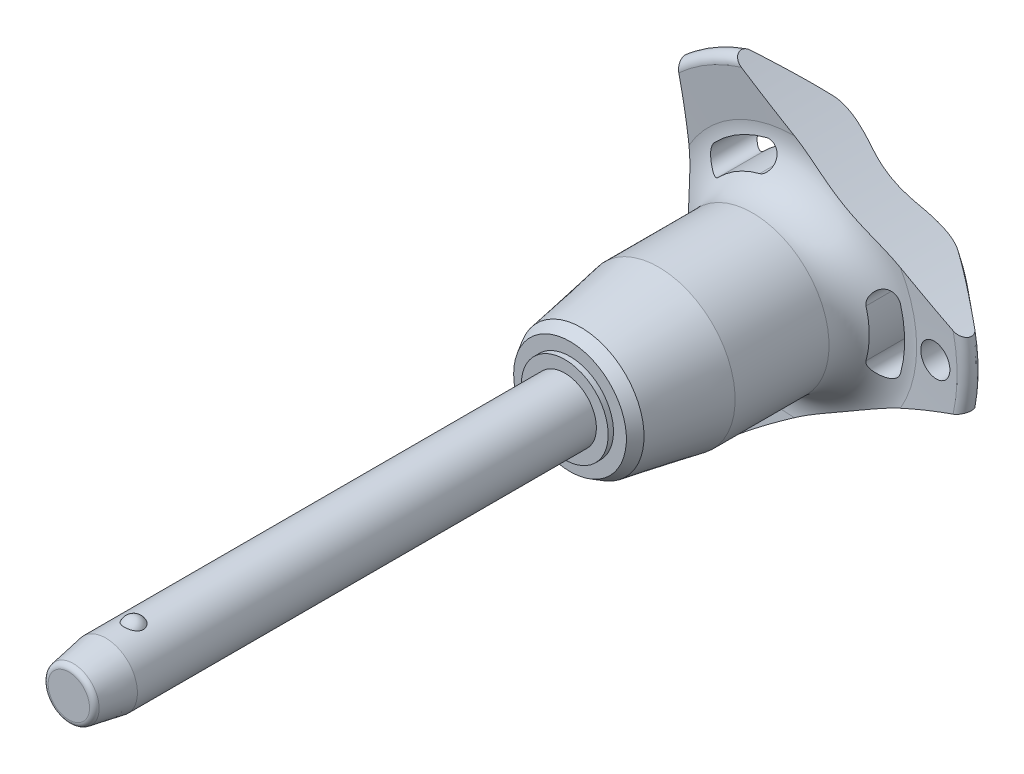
from build123d import *

# Parameters (mm, degrees)
SKETCH1_R           = 3
BOSS_EXTRUDE1_DEPTH = 40
SKETCH2_R           = 2.5
BOSS_EXTRUDE2_DEPTH = 26.7
BOSS_EXTRUDE3_START = 7
SKETCH1_2_R         = 3
BOSS_EXTRUDE3_DEPTH = 7
CHAMFER1_SIZE       = 3.5
CHAMFER1_SIZE2      = 0.617144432
FILLET1_R           = 0.5
SKETCH6_R           = 79.96
CUT_EXTRUDE1_DEPTH  = 71.711449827
CIRPATTERN1_COUNT   = 3
SKETCH7_R           = 1.5
CUT_EXTRUDE2_DEPTH  = 71.495866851


with BuildPart() as part:
    # Sketch1 → Boss-Extrude1 (new body)
    with BuildSketch(Plane.XY):
        Circle(SKETCH1_R)
    extrude(amount=-BOSS_EXTRUDE1_DEPTH)

    # Sketch2 → Boss-Extrude2 (add)
    with BuildSketch(Plane(origin=(0, 0, -40), x_dir=(-1, 0, 0), z_dir=(0, 0, -1))):
        Circle(SKETCH2_R)
    extrude(amount=BOSS_EXTRUDE2_DEPTH)

    # Sketch3 → Revolve1 (revolve)
    with BuildSketch(Plane(origin=(0, 0, 0), x_dir=(0, 0, -1), z_dir=(1, 0, 0))):
        with BuildLine():
            Line((-0.866025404, 3.5), (-0.866025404, 1.5))
            ThreePointArc((-0.866025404, 1.5), (0.133974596, 2.5), (-0.866025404, 3.5))
        make_face()
        with BuildLine():
            Line((-0.866025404, -1.5), (-0.866025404, -3.5))
            ThreePointArc((-0.866025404, -3.5), (0.133974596, -2.5), (-0.866025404, -1.5))
        make_face()
    revolve(axis=Axis((0, -1.5, 0.866025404), (0, 1, 0)))

    # Sketch1_2 → Boss-Extrude3 (add)
    with BuildSketch(Plane.XY.offset(BOSS_EXTRUDE3_START)):
        Circle(SKETCH1_2_R)
    extrude(amount=-BOSS_EXTRUDE3_DEPTH)

    # Chamfer1
    chamfer1_edges = [part.edges().sort_by_distance(p)[0] for p in [
        (-3, 0, 7),
    ]]
    chamfer1_side = [part.faces().sort_by_distance(p)[0] for p in [
        (-3, 0, -16.5),
    ]]
    chamfer(chamfer1_edges, length=CHAMFER1_SIZE, length2=CHAMFER1_SIZE2, reference=chamfer1_side[0])

    # Fillet1
    fillet1_edges = [part.edges().sort_by_distance(p)[0] for p in [
        (-2.382855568, 0, 7),
        (2.5, 0, -66.7),
    ]]
    fillet(fillet1_edges, radius=FILLET1_R)

    # Sketch4 → Revolve2 (revolve)
    with BuildSketch(Plane(origin=(0, 0, 0), x_dir=(0, 0, -1), z_dir=(1, 0, 0)), mode=Mode.PRIVATE) as revolve2_sk:
        Polygon((40, 0), (40, 4.118359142), (40.5, 4.118359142), (40.5, 5.343400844), (41.560917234, 5.955921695), (48.9, 7.25), (57.8, 7.25), (57.8, 0), align=None)
    revolve(revolve2_sk.sketch.rotate(Axis((0, 0, -57.8), (0, 0, 1)), 90), axis=Axis((0, 0, -57.8), (0, 0, 1)))

    # Sketch5 → Revolve3 (revolve)
    with BuildSketch(Plane(origin=(0, 0, 0), x_dir=(0, 0, -1), z_dir=(1, 0, 0)), mode=Mode.PRIVATE) as revolve3_sk:
        with BuildLine():
            Line((61.78715932, 11.570250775), (61.452568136, 15.735949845))
            ThreePointArc((61.452568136, 15.735949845), (61.946485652, 16.540188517), (62.862835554, 16.314230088))
            Line((62.862835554, 16.314230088), (66.326414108, 12.186497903))
            ThreePointArc((66.326414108, 12.186497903), (66.7, 11.109282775), (66.261488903, 10.056825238))
            ThreePointArc((66.261488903, 10.056825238), (63.289873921, 5.413681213), (62.25, 0))
            Line((62.25, 0), (57.8, 0))
            Line((57.8, 0), (57.8, 7.25))
            ThreePointArc((57.8, 7.25), (60.739473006, 8.537160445), (61.78715932, 11.570250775))
        make_face()
    revolve(revolve3_sk.sketch.rotate(Axis((0, 0, -62.25), (0, 0, 1)), 90), axis=Axis((0, 0, -62.25), (0, 0, 1)))

    # Sketch6 → Cut-Extrude1 (cut, through all)
    with BuildSketch(Plane.XY):
        with Locations((-89.76, 0)):
            Circle(SKETCH6_R)
        with BuildLine():
            ThreePointArc((10.099921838, -2.834717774), (10.490188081, 0), (10.099921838, 2.834717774))
            ThreePointArc((10.099921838, 2.834717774), (8.768180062, 3.582738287), (8.020159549, 2.250996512))
            ThreePointArc((8.020159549, 2.250996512), (8.330062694, 0), (8.020159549, -2.250996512))
            ThreePointArc((8.020159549, -2.250996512), (8.768180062, -3.582738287), (10.099921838, -2.834717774))
        make_face()
    cut_extrude1 = extrude(amount=-CUT_EXTRUDE1_DEPTH, mode=Mode.SUBTRACT)

    # CirPattern1: Cut-Extrude1 ×3 about axis
    cirpattern1_axis = Axis((0, 0, 0), (0, 0, 1))
    for i in range(1, CIRPATTERN1_COUNT):
        add(cut_extrude1.rotate(cirpattern1_axis, i * 360 / CIRPATTERN1_COUNT), mode=Mode.SUBTRACT)

    # Sketch7 → Cut-Extrude2 (cut, through all)
    with BuildSketch(Plane.XY):
        with Locations(Location((13.490188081, 0, 0), (0, 0, 225.221865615))):
            Circle(SKETCH7_R)
    extrude(amount=-CUT_EXTRUDE2_DEPTH, mode=Mode.SUBTRACT)


solid = part.part
